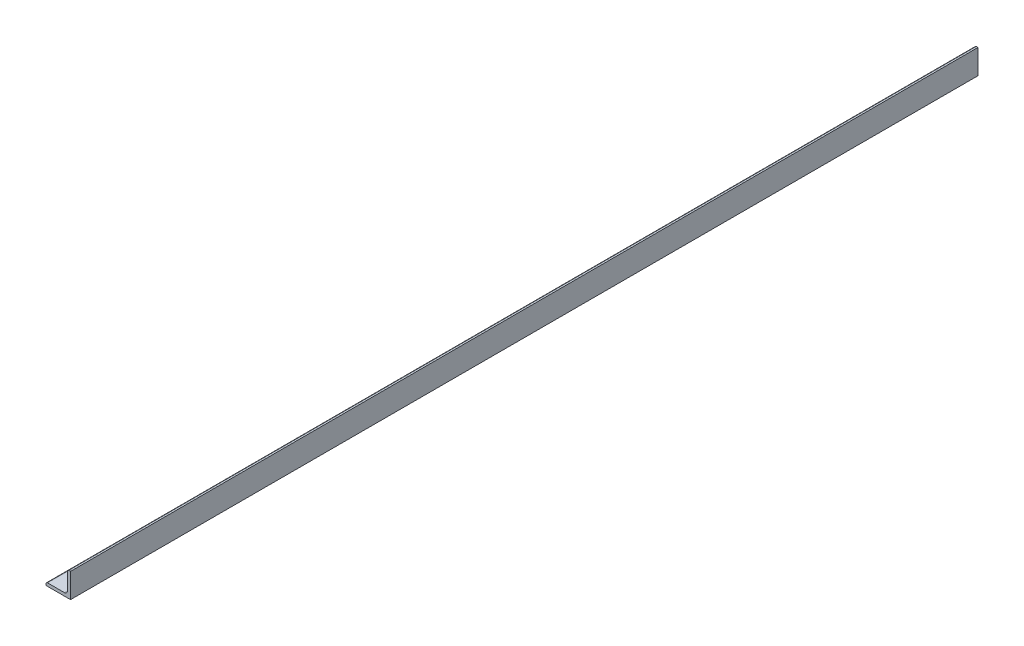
from build123d import *

# Parameters (mm, degrees)
BOSS_EXTRUDE1_DEPTH = 234.95


with BuildPart() as part:
    # Sketch2 → Boss-Extrude1 (new, symmetric)
    with BuildSketch(Plane.XY):
        with BuildLine():
            Line((-6.35, -6.35), (6.35, -6.35))
            Line((6.35, -6.35), (6.35, 6.35))
            Line((6.35, 6.35), (5.55625, 6.35))
            ThreePointArc((5.55625, 6.35), (4.994983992, 6.117516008), (4.7625, 5.55625))
            Line((4.7625, 5.55625), (4.7625, -3.1877))
            ThreePointArc((4.7625, -3.1877), (4.301251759, -4.301251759), (3.1877, -4.7625))
            Line((3.1877, -4.7625), (-5.55625, -4.7625))
            ThreePointArc((-5.55625, -4.7625), (-6.117516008, -4.994983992), (-6.35, -5.55625))
            Line((-6.35, -5.55625), (-6.35, -6.35))
        make_face()
    extrude(amount=BOSS_EXTRUDE1_DEPTH, both=True)


solid = part.part
